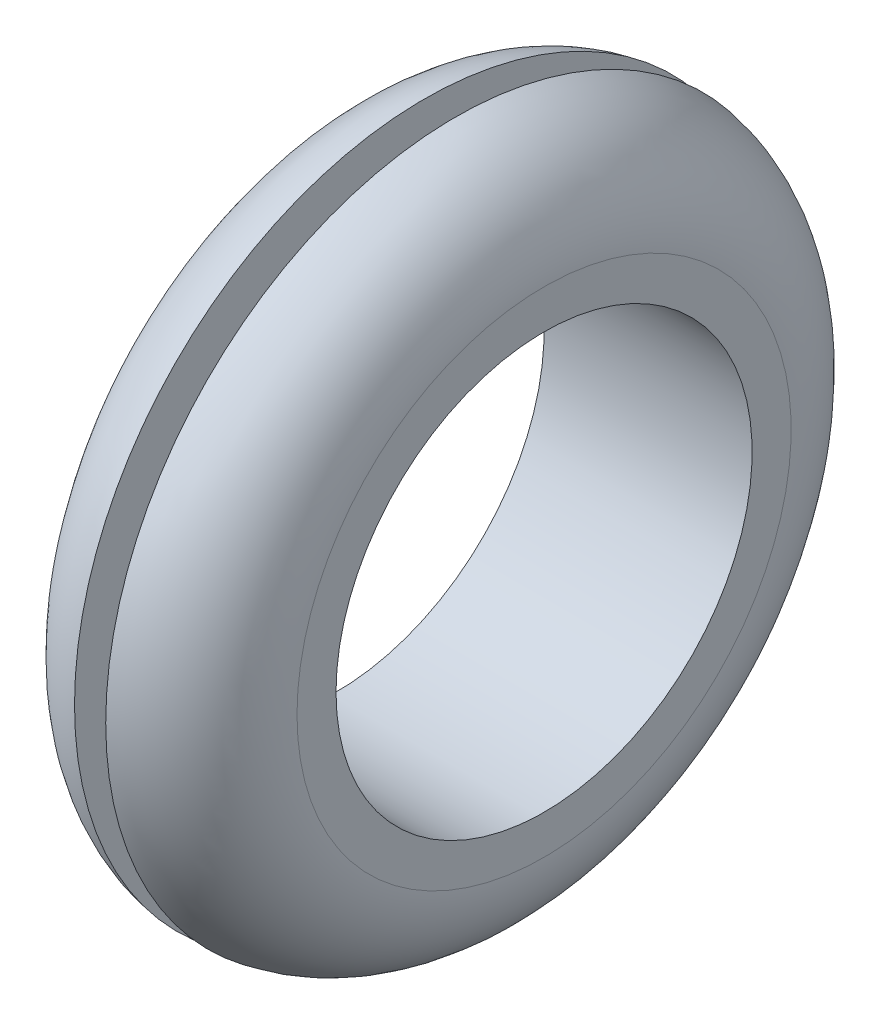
from build123d import *


with BuildPart() as part:
    # Esquisse1 → R_volution1 (revolve)
    with BuildSketch(Plane(origin=(0, 0, 0), x_dir=(-1, 0, 0), z_dir=(0, 0, -1)), mode=Mode.PRIVATE) as r_volution1_sk:
        with BuildLine():
            Line((-4, 8), (4, 8))
            Line((4, 8), (4, 9.5))
            ThreePointArc((4, 9.5), (3.033150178, 12.107680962), (0.6, 13.454743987))
            Line((0.6, 13.454743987), (0.6, 10.25))
            Line((0.6, 10.25), (-0.6, 10.25))
            Line((-0.6, 10.25), (-0.6, 13.454743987))
            ThreePointArc((-0.6, 13.454743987), (-3.033150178, 12.107680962), (-4, 9.5))
            Line((-4, 9.5), (-4, 8))
        make_face()
    revolve(r_volution1_sk.sketch.rotate(Axis((4.001250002, 0, 0), (-1, 0, 0)), 270), axis=Axis((4.001250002, 0, 0), (-1, 0, 0)))


solid = part.part
